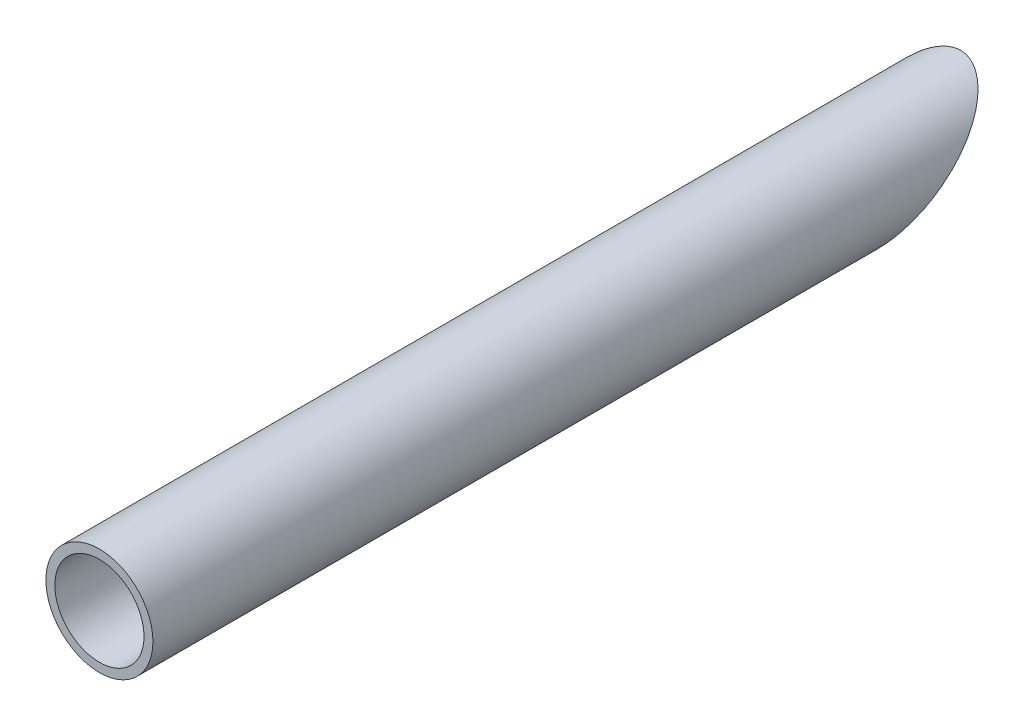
ISO-10303-21;
HEADER;
FILE_DESCRIPTION(('STEP AP214'),'2;1');
FILE_NAME('part.step','',(''),(''),'','','');
FILE_SCHEMA(('AUTOMOTIVE_DESIGN { 1 0 10303 214 1 1 1 1 }'));
ENDSEC;
DATA;
#1=APPLICATION_CONTEXT('core data for automotive mechanical design processes');
#2=APPLICATION_PROTOCOL_DEFINITION('international standard','automotive_design',2000,#1);
#3=PRODUCT_CONTEXT('',#1,'mechanical');
#4=PRODUCT('Part','Part','',(#3));
#5=PRODUCT_RELATED_PRODUCT_CATEGORY('part','',(#4));
#6=PRODUCT_DEFINITION_FORMATION('','',#4);
#7=PRODUCT_DEFINITION_CONTEXT('part definition',#1,'design');
#8=PRODUCT_DEFINITION('design','',#6,#7);
#9=PRODUCT_DEFINITION_SHAPE('','',#8);
#10=(LENGTH_UNIT() NAMED_UNIT(*) SI_UNIT(.MILLI.,.METRE.));
#11=(NAMED_UNIT(*) PLANE_ANGLE_UNIT() SI_UNIT($,.RADIAN.));
#12=(NAMED_UNIT(*) SI_UNIT($,.STERADIAN.) SOLID_ANGLE_UNIT());
#13=UNCERTAINTY_MEASURE_WITH_UNIT(LENGTH_MEASURE(1.E-05),#10,'distance_accuracy_value','');
#14=(GEOMETRIC_REPRESENTATION_CONTEXT(3) GLOBAL_UNCERTAINTY_ASSIGNED_CONTEXT((#13)) GLOBAL_UNIT_ASSIGNED_CONTEXT((#10,
#11,#12)) REPRESENTATION_CONTEXT('',''));
#15=CARTESIAN_POINT('',(0.,0.,0.));
#16=DIRECTION('',(0.,0.,1.));
#17=DIRECTION('',(1.,0.,0.));
#18=AXIS2_PLACEMENT_3D('',#15,#16,#17);
#19=CARTESIAN_POINT('',(0.,0.,-500.));
#20=DIRECTION('',(0.,0.,1.));
#21=DIRECTION('',(1.,0.,0.));
#22=AXIS2_PLACEMENT_3D('',#19,#20,#21);
#23=CYLINDRICAL_SURFACE('',#22,30.);
#24=CARTESIAN_POINT('',(0.,0.,-443.786240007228));
#25=DIRECTION('',(-0.0335688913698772,0.797225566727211,0.602747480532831));
#26=DIRECTION('',(0.0253575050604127,-0.602213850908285,0.79793199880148));
#27=AXIS2_PLACEMENT_3D('',#24,#25,#26);
#28=ELLIPSE('',#27,49.7720869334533,30.);
#29=CARTESIAN_POINT('',(1.26209594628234,-29.9734401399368,-404.071499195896));
#30=VERTEX_POINT('',#29);
#31=EDGE_CURVE('E11',#30,#30,#28,.F.);
#32=ORIENTED_EDGE('',*,*,#31,.F.);
#33=EDGE_LOOP('',(#32));
#34=FACE_BOUND('',#33,.T.);
#35=CARTESIAN_POINT('',(0.,0.,0.));
#36=DIRECTION('',(0.,0.,1.));
#37=DIRECTION('',(1.,0.,0.));
#38=AXIS2_PLACEMENT_3D('',#35,#36,#37);
#39=CIRCLE('',#38,30.);
#40=CARTESIAN_POINT('',(30.,0.,0.));
#41=VERTEX_POINT('',#40);
#42=EDGE_CURVE('E42',#41,#41,#39,.T.);
#43=ORIENTED_EDGE('',*,*,#42,.F.);
#44=EDGE_LOOP('',(#43));
#45=FACE_BOUND('',#44,.T.);
#46=ADVANCED_FACE('F35',(#34,#45),#23,.T.);
#47=CARTESIAN_POINT('',(0.,0.,0.));
#48=DIRECTION('',(0.,0.,1.));
#49=DIRECTION('',(1.,0.,0.));
#50=AXIS2_PLACEMENT_3D('',#47,#48,#49);
#51=PLANE('',#50);
#52=CARTESIAN_POINT('',(0.,0.,0.));
#53=DIRECTION('',(0.,0.,1.));
#54=DIRECTION('',(1.,0.,0.));
#55=AXIS2_PLACEMENT_3D('',#52,#53,#54);
#56=CIRCLE('',#55,25.);
#57=CARTESIAN_POINT('',(25.,0.,0.));
#58=VERTEX_POINT('',#57);
#59=EDGE_CURVE('E47',#58,#58,#56,.T.);
#60=ORIENTED_EDGE('',*,*,#59,.F.);
#61=EDGE_LOOP('',(#60));
#62=FACE_BOUND('',#61,.T.);
#63=ORIENTED_EDGE('',*,*,#42,.T.);
#64=EDGE_LOOP('',(#63));
#65=FACE_BOUND('',#64,.T.);
#66=ADVANCED_FACE('F63',(#62,#65),#51,.T.);
#67=CARTESIAN_POINT('',(0.,0.,-500.));
#68=DIRECTION('',(0.,0.,1.));
#69=DIRECTION('',(1.,0.,0.));
#70=AXIS2_PLACEMENT_3D('',#67,#68,#69);
#71=CYLINDRICAL_SURFACE('',#70,25.);
#72=CARTESIAN_POINT('',(0.,0.,-443.786240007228));
#73=DIRECTION('',(-0.0335688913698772,0.797225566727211,0.602747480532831));
#74=DIRECTION('',(0.0253575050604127,-0.602213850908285,0.79793199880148));
#75=AXIS2_PLACEMENT_3D('',#72,#73,#74);
#76=ELLIPSE('',#75,41.4767391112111,25.);
#77=CARTESIAN_POINT('',(1.05174662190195,-24.9778667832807,-410.690622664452));
#78=VERTEX_POINT('',#77);
#79=EDGE_CURVE('E38',#78,#78,#76,.F.);
#80=ORIENTED_EDGE('',*,*,#79,.T.);
#81=EDGE_LOOP('',(#80));
#82=FACE_BOUND('',#81,.T.);
#83=ORIENTED_EDGE('',*,*,#59,.T.);
#84=EDGE_LOOP('',(#83));
#85=FACE_BOUND('',#84,.T.);
#86=ADVANCED_FACE('F55',(#82,#85),#71,.F.);
#87=CARTESIAN_POINT('',(8.97937759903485,-213.25069441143,-161.229549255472));
#88=DIRECTION('',(-0.0335688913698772,0.797225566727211,0.602747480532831));
#89=DIRECTION('',(0.,-0.603087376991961,0.797675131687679));
#90=AXIS2_PLACEMENT_3D('',#87,#88,#89);
#91=PLANE('',#90);
#92=ORIENTED_EDGE('',*,*,#31,.T.);
#93=EDGE_LOOP('',(#92));
#94=FACE_BOUND('',#93,.T.);
#95=ORIENTED_EDGE('',*,*,#79,.F.);
#96=EDGE_LOOP('',(#95));
#97=FACE_BOUND('',#96,.T.);
#98=ADVANCED_FACE('F57',(#94,#97),#91,.F.);
#99=CLOSED_SHELL('',(#46,#66,#86,#98));
#100=MANIFOLD_SOLID_BREP('B2',#99);
#101=ADVANCED_BREP_SHAPE_REPRESENTATION('',(#18,#100),#14);
#102=SHAPE_DEFINITION_REPRESENTATION(#9,#101);
ENDSEC;
END-ISO-10303-21;
